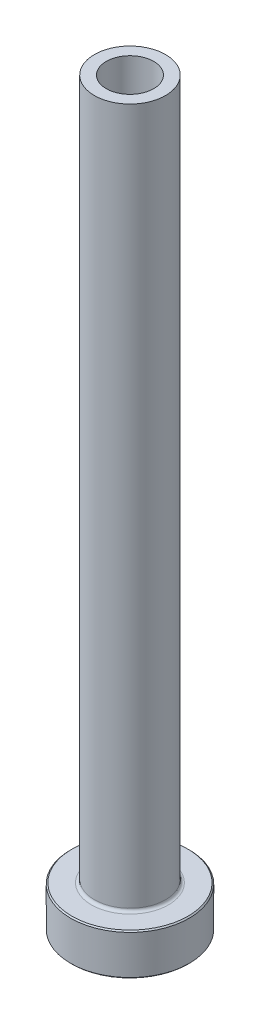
from build123d import *

# Parameters (mm, degrees)
FILLET1_R     = 0.5
CHAMFER1_SIZE = 0.2
CHAMFER3_SIZE = 0.5


with BuildPart() as part:
    # Sketch1 → Revolve1 (revolve)
    with BuildSketch(Plane.XY, mode=Mode.PRIVATE) as revolve1_sk:
        Polygon((-4, 125), (-6, 125), (-6, 7), (-10, 7), (-10, 0), (-4.25, 0), (-4.25, 68), (-4, 80), align=None)
    revolve(revolve1_sk.sketch.rotate(Axis((0, 92.187680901, 0), (0, -1, 0)), 270), axis=Axis((0, 92.187680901, 0), (0, -1, 0)))

    # Fillet1
    fillet1_edges = [part.edges().sort_by_distance(p)[0] for p in [
        (0, 7, -6),
    ]]
    fillet(fillet1_edges, radius=FILLET1_R)

    # Chamfer1
    chamfer1_edges = [part.edges().sort_by_distance(p)[0] for p in [
        (0, 0, -10),
        (0, 7, -10),
    ]]
    chamfer(chamfer1_edges, length=CHAMFER1_SIZE)

    # Chamfer3
    chamfer3_edges = [part.edges().sort_by_distance(p)[0] for p in [
        (0, 0, -4.25),
    ]]
    chamfer(chamfer3_edges, length=CHAMFER3_SIZE)


solid = part.part
